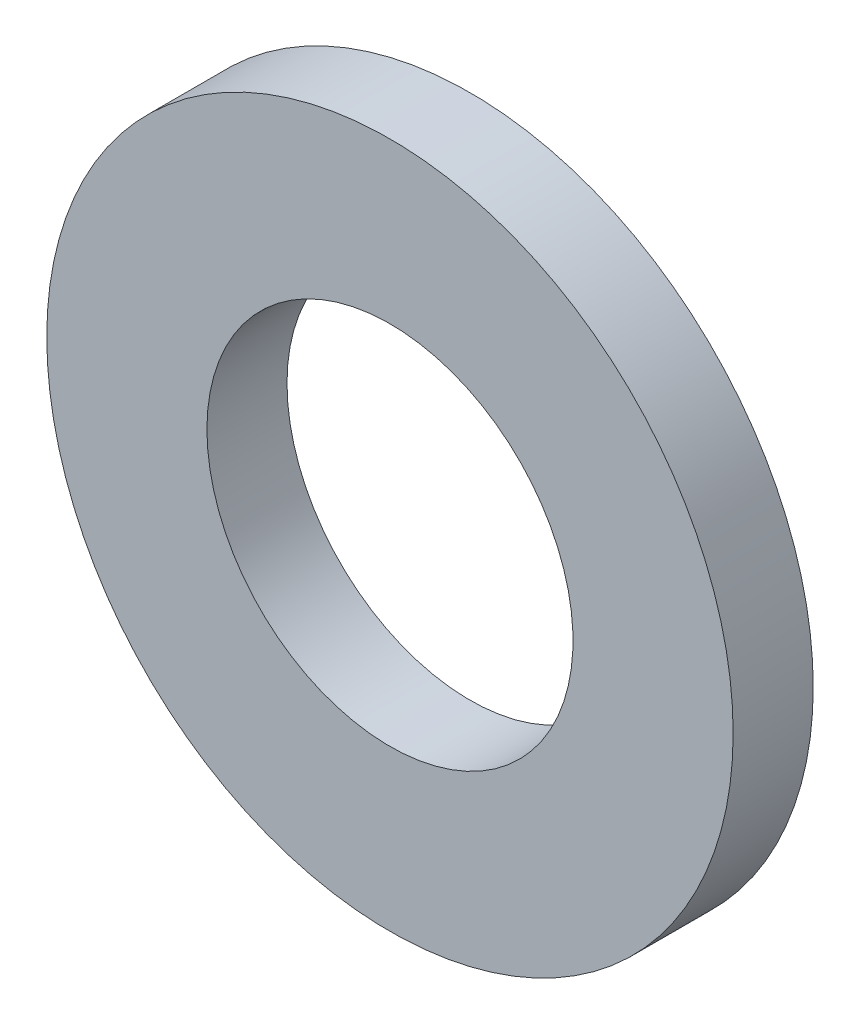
ISO-10303-21;
HEADER;
FILE_DESCRIPTION(('STEP AP214'),'2;1');
FILE_NAME('part.step','',(''),(''),'','','');
FILE_SCHEMA(('AUTOMOTIVE_DESIGN { 1 0 10303 214 1 1 1 1 }'));
ENDSEC;
DATA;
#1=APPLICATION_CONTEXT('core data for automotive mechanical design processes');
#2=APPLICATION_PROTOCOL_DEFINITION('international standard','automotive_design',2000,#1);
#3=PRODUCT_CONTEXT('',#1,'mechanical');
#4=PRODUCT('Part','Part','',(#3));
#5=PRODUCT_RELATED_PRODUCT_CATEGORY('part','',(#4));
#6=PRODUCT_DEFINITION_FORMATION('','',#4);
#7=PRODUCT_DEFINITION_CONTEXT('part definition',#1,'design');
#8=PRODUCT_DEFINITION('design','',#6,#7);
#9=PRODUCT_DEFINITION_SHAPE('','',#8);
#10=(LENGTH_UNIT() NAMED_UNIT(*) SI_UNIT(.MILLI.,.METRE.));
#11=(NAMED_UNIT(*) PLANE_ANGLE_UNIT() SI_UNIT($,.RADIAN.));
#12=(NAMED_UNIT(*) SI_UNIT($,.STERADIAN.) SOLID_ANGLE_UNIT());
#13=UNCERTAINTY_MEASURE_WITH_UNIT(LENGTH_MEASURE(1.E-05),#10,'distance_accuracy_value','');
#14=(GEOMETRIC_REPRESENTATION_CONTEXT(3) GLOBAL_UNCERTAINTY_ASSIGNED_CONTEXT((#13)) GLOBAL_UNIT_ASSIGNED_CONTEXT((#10,
#11,#12)) REPRESENTATION_CONTEXT('',''));
#15=CARTESIAN_POINT('',(0.,0.,0.));
#16=DIRECTION('',(0.,0.,1.));
#17=DIRECTION('',(1.,0.,0.));
#18=AXIS2_PLACEMENT_3D('',#15,#16,#17);
#19=CARTESIAN_POINT('',(0.,0.,0.));
#20=DIRECTION('',(0.,0.,1.));
#21=DIRECTION('',(1.,0.,0.));
#22=AXIS2_PLACEMENT_3D('',#19,#20,#21);
#23=PLANE('',#22);
#24=CARTESIAN_POINT('',(0.,0.,0.));
#25=DIRECTION('',(0.,0.,-1.));
#26=DIRECTION('',(-1.,0.,0.));
#27=AXIS2_PLACEMENT_3D('',#24,#25,#26);
#28=CIRCLE('',#27,3.);
#29=CARTESIAN_POINT('',(-3.,0.,0.));
#30=VERTEX_POINT('',#29);
#31=EDGE_CURVE('E27',#30,#30,#28,.F.);
#32=ORIENTED_EDGE('',*,*,#31,.F.);
#33=EDGE_LOOP('',(#32));
#34=FACE_BOUND('',#33,.T.);
#35=CARTESIAN_POINT('',(0.,0.,0.));
#36=DIRECTION('',(0.,0.,-1.));
#37=DIRECTION('',(-1.,0.,0.));
#38=AXIS2_PLACEMENT_3D('',#35,#36,#37);
#39=CIRCLE('',#38,1.6);
#40=CARTESIAN_POINT('',(-1.6,0.,0.));
#41=VERTEX_POINT('',#40);
#42=EDGE_CURVE('E18',#41,#41,#39,.F.);
#43=ORIENTED_EDGE('',*,*,#42,.T.);
#44=EDGE_LOOP('',(#43));
#45=FACE_BOUND('',#44,.T.);
#46=ADVANCED_FACE('F15',(#34,#45),#23,.F.);
#47=CARTESIAN_POINT('',(0.,0.,0.7));
#48=DIRECTION('',(0.,0.,-1.));
#49=DIRECTION('',(-1.,0.,0.));
#50=AXIS2_PLACEMENT_3D('',#47,#48,#49);
#51=CYLINDRICAL_SURFACE('',#50,1.6);
#52=ORIENTED_EDGE('',*,*,#42,.F.);
#53=EDGE_LOOP('',(#52));
#54=FACE_BOUND('',#53,.T.);
#55=CARTESIAN_POINT('',(0.,0.,0.7));
#56=DIRECTION('',(0.,0.,-1.));
#57=DIRECTION('',(-1.,0.,0.));
#58=AXIS2_PLACEMENT_3D('',#55,#56,#57);
#59=CIRCLE('',#58,1.6);
#60=CARTESIAN_POINT('',(-1.6,0.,0.7));
#61=VERTEX_POINT('',#60);
#62=EDGE_CURVE('E22',#61,#61,#59,.T.);
#63=ORIENTED_EDGE('',*,*,#62,.F.);
#64=EDGE_LOOP('',(#63));
#65=FACE_BOUND('',#64,.T.);
#66=ADVANCED_FACE('F36',(#54,#65),#51,.F.);
#67=CARTESIAN_POINT('',(0.,0.,0.7));
#68=DIRECTION('',(0.,0.,-1.));
#69=DIRECTION('',(-1.,0.,0.));
#70=AXIS2_PLACEMENT_3D('',#67,#68,#69);
#71=CYLINDRICAL_SURFACE('',#70,3.);
#72=ORIENTED_EDGE('',*,*,#31,.T.);
#73=EDGE_LOOP('',(#72));
#74=FACE_BOUND('',#73,.T.);
#75=CARTESIAN_POINT('',(0.,0.,0.7));
#76=DIRECTION('',(0.,0.,-1.));
#77=DIRECTION('',(-1.,0.,0.));
#78=AXIS2_PLACEMENT_3D('',#75,#76,#77);
#79=CIRCLE('',#78,3.);
#80=CARTESIAN_POINT('',(-3.,0.,0.7));
#81=VERTEX_POINT('',#80);
#82=EDGE_CURVE('E10',#81,#81,#79,.F.);
#83=ORIENTED_EDGE('',*,*,#82,.F.);
#84=EDGE_LOOP('',(#83));
#85=FACE_BOUND('',#84,.T.);
#86=ADVANCED_FACE('F39',(#74,#85),#71,.T.);
#87=CARTESIAN_POINT('',(0.,0.,0.7));
#88=DIRECTION('',(0.,0.,1.));
#89=DIRECTION('',(1.,0.,0.));
#90=AXIS2_PLACEMENT_3D('',#87,#88,#89);
#91=PLANE('',#90);
#92=ORIENTED_EDGE('',*,*,#82,.T.);
#93=EDGE_LOOP('',(#92));
#94=FACE_BOUND('',#93,.T.);
#95=ORIENTED_EDGE('',*,*,#62,.T.);
#96=EDGE_LOOP('',(#95));
#97=FACE_BOUND('',#96,.T.);
#98=ADVANCED_FACE('F42',(#94,#97),#91,.T.);
#99=CLOSED_SHELL('',(#46,#66,#86,#98));
#100=MANIFOLD_SOLID_BREP('B1',#99);
#101=ADVANCED_BREP_SHAPE_REPRESENTATION('',(#18,#100),#14);
#102=SHAPE_DEFINITION_REPRESENTATION(#9,#101);
ENDSEC;
END-ISO-10303-21;
